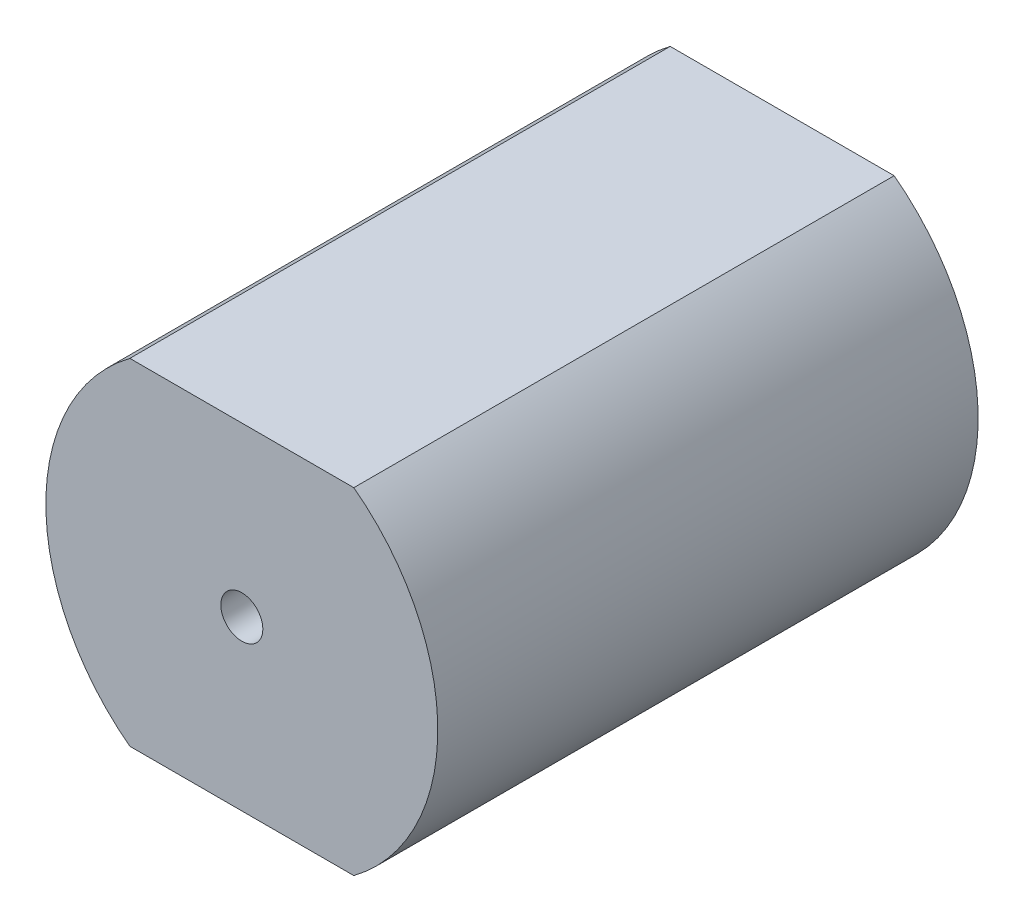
from build123d import *

# Parameters (mm, degrees)
BOSS_EXTRU_1_DEPTH      = 19.3
ESQUISSE2_R             = 0.75
ENL_V_MAT_EXTRU_1_DEPTH = 2


with BuildPart() as part:
    # Esquisse1 → Boss.-Extru.1 (new body)
    with BuildSketch(Plane.XY):
        with BuildLine():
            Line((4, 6), (-4, 6))
            ThreePointArc((-4, 6), (-7, 0), (-4, -6))
            Line((-4, -6), (4, -6))
            ThreePointArc((4, -6), (7, 0), (4, 6))
        make_face()
    extrude(amount=BOSS_EXTRU_1_DEPTH)

    # Esquisse2 → Enl_v. mat.-Extru.1 (cut)
    with BuildSketch(Plane.XY.offset(19.3)):
        Circle(ESQUISSE2_R)
    extrude(amount=-ENL_V_MAT_EXTRU_1_DEPTH, mode=Mode.SUBTRACT)


solid = part.part
